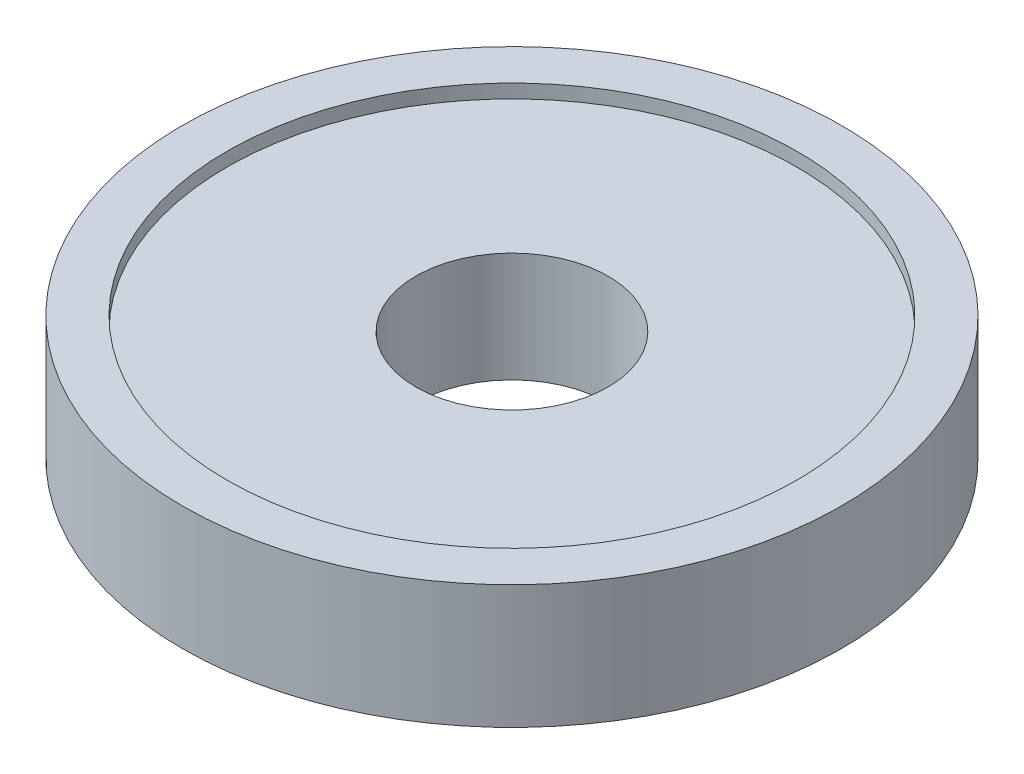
from build123d import *

# Parameters (mm, degrees)
SKETCH1_R           = 48
SKETCH1_R_2         = 14
BOSS_EXTRUDE1_DEPTH = 9
SKETCH4_R           = 41.5
CUT_EXTRUDE1_DEPTH  = 2


with BuildPart() as part:
    # Sketch1 → Boss-Extrude1 (new, symmetric)
    with BuildSketch(Plane(origin=(0, 0, 0), x_dir=(1, 0, 0), z_dir=(0, 1, 0))):
        with Locations(Location((0, 0, 0), (0, 0, 270))):
            Circle(SKETCH1_R)
        with Locations(Location((0, 0, 0), (0, 0, 270))):
            Circle(SKETCH1_R_2, mode=Mode.SUBTRACT)
    extrude(amount=BOSS_EXTRUDE1_DEPTH, both=True)

    # Sketch4 → Cut-Extrude1 (cut)
    with BuildSketch(Plane(origin=(0, 9, 0), x_dir=(1, 0, 0), z_dir=(0, 1, 0))):
        with Locations(Location((0, 0, 0), (0, 0, 270))):
            Circle(SKETCH4_R)
    extrude(amount=-CUT_EXTRUDE1_DEPTH, mode=Mode.SUBTRACT)


solid = part.part
